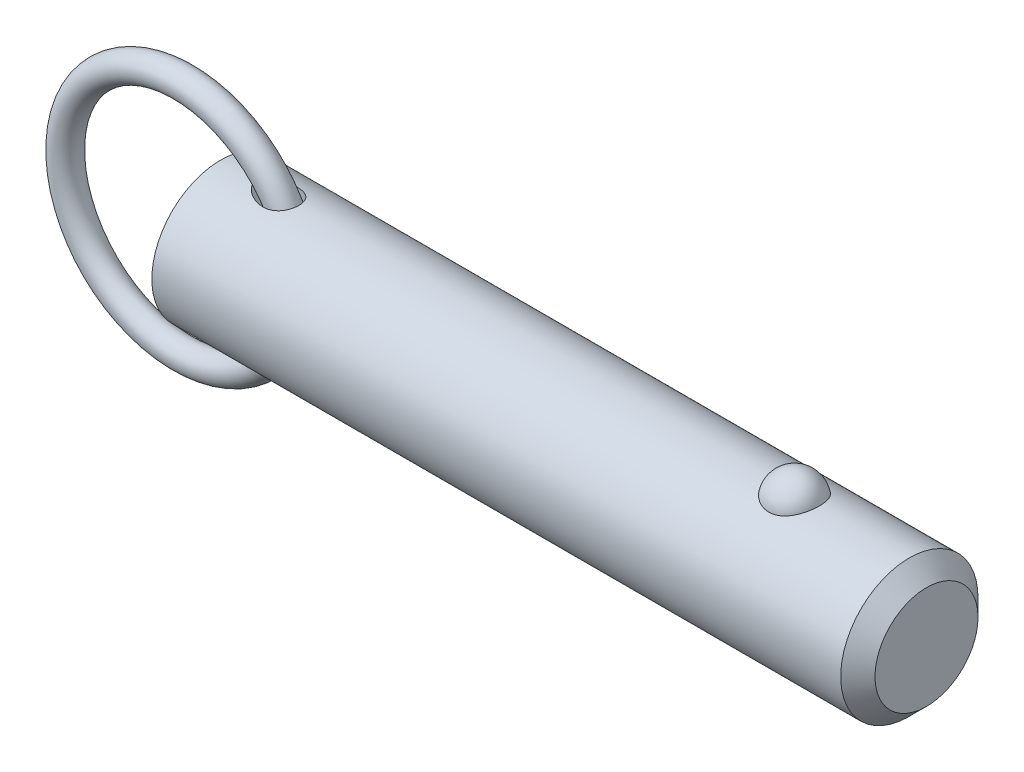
ISO-10303-21;
HEADER;
FILE_DESCRIPTION(('STEP AP214'),'2;1');
FILE_NAME('part.step','',(''),(''),'','','');
FILE_SCHEMA(('AUTOMOTIVE_DESIGN { 1 0 10303 214 1 1 1 1 }'));
ENDSEC;
DATA;
#1=APPLICATION_CONTEXT('core data for automotive mechanical design processes');
#2=APPLICATION_PROTOCOL_DEFINITION('international standard','automotive_design',2000,#1);
#3=PRODUCT_CONTEXT('',#1,'mechanical');
#4=PRODUCT('Part','Part','',(#3));
#5=PRODUCT_RELATED_PRODUCT_CATEGORY('part','',(#4));
#6=PRODUCT_DEFINITION_FORMATION('','',#4);
#7=PRODUCT_DEFINITION_CONTEXT('part definition',#1,'design');
#8=PRODUCT_DEFINITION('design','',#6,#7);
#9=PRODUCT_DEFINITION_SHAPE('','',#8);
#10=(LENGTH_UNIT() NAMED_UNIT(*) SI_UNIT(.MILLI.,.METRE.));
#11=(NAMED_UNIT(*) PLANE_ANGLE_UNIT() SI_UNIT($,.RADIAN.));
#12=(NAMED_UNIT(*) SI_UNIT($,.STERADIAN.) SOLID_ANGLE_UNIT());
#13=UNCERTAINTY_MEASURE_WITH_UNIT(LENGTH_MEASURE(1.E-05),#10,'distance_accuracy_value','');
#14=(GEOMETRIC_REPRESENTATION_CONTEXT(3) GLOBAL_UNCERTAINTY_ASSIGNED_CONTEXT((#13)) GLOBAL_UNIT_ASSIGNED_CONTEXT((#10,
#11,#12)) REPRESENTATION_CONTEXT('',''));
#15=CARTESIAN_POINT('',(0.,0.,0.));
#16=DIRECTION('',(0.,0.,1.));
#17=DIRECTION('',(1.,0.,0.));
#18=AXIS2_PLACEMENT_3D('',#15,#16,#17);
#19=CARTESIAN_POINT('',(-6.08699288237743,0.,0.));
#20=DIRECTION('',(0.,0.,1.));
#21=DIRECTION('',(1.,0.,0.));
#22=AXIS2_PLACEMENT_3D('',#19,#20,#21);
#23=TOROIDAL_SURFACE('',#22,19.05,2.223);
#24=CARTESIAN_POINT('',(15.1860071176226,0.,0.));
#25=VERTEX_POINT('',#24);
#26=VERTEX_LOOP('',#25);
#27=FACE_BOUND('',#26,.T.);
#28=ADVANCED_FACE('P0_F12',(#27),#23,.T.);
#29=CLOSED_SHELL('',(#28));
#30=MANIFOLD_SOLID_BREP('P0_B1',#29);
#31=CARTESIAN_POINT('',(0.,0.,0.));
#32=DIRECTION('',(1.,0.,0.));
#33=DIRECTION('',(0.,0.,-1.));
#34=AXIS2_PLACEMENT_3D('',#31,#32,#33);
#35=CYLINDRICAL_SURFACE('',#34,11.115);
#36=CARTESIAN_POINT('',(6.414051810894,11.0227946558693,-1.42871369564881));
#37=CARTESIAN_POINT('',(6.49338916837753,11.0115377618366,-1.5155664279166));
#38=CARTESIAN_POINT('',(6.57765461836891,10.9998263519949,-1.59789397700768));
#39=CARTESIAN_POINT('',(6.75386647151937,10.9760304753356,-1.75391400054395));
#40=CARTESIAN_POINT('',(6.84582247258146,10.9639455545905,-1.82759540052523));
#41=CARTESIAN_POINT('',(7.03627827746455,10.9397989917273,-1.96698954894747));
#42=CARTESIAN_POINT('',(7.13480838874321,10.9277377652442,-2.03266078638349));
#43=CARTESIAN_POINT('',(7.33681032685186,10.9041015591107,-2.1558582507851));
#44=CARTESIAN_POINT('',(7.44028007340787,10.8925263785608,-2.21338786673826));
#45=CARTESIAN_POINT('',(7.64386117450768,10.8710104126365,-2.31666528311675));
#46=CARTESIAN_POINT('',(7.74368989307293,10.8610119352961,-2.36295942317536));
#47=CARTESIAN_POINT('',(7.94637195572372,10.8420168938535,-2.44863486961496));
#48=CARTESIAN_POINT('',(8.04922612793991,10.8330206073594,-2.48801426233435));
#49=CARTESIAN_POINT('',(8.36115573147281,10.807980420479,-2.59542730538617));
#50=CARTESIAN_POINT('',(8.57411849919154,10.7938278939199,-2.65299817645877));
#51=CARTESIAN_POINT('',(9.00825016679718,10.7725818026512,-2.73800108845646));
#52=CARTESIAN_POINT('',(9.22947335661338,10.7655491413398,-2.76517330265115));
#53=CARTESIAN_POINT('',(9.67368141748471,10.7605872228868,-2.78445308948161));
#54=CARTESIAN_POINT('',(9.89666486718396,10.7626512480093,-2.77658653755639));
#55=CARTESIAN_POINT('',(10.2950172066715,10.7754452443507,-2.72644436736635));
#56=CARTESIAN_POINT('',(10.4712789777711,10.7844280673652,-2.69109376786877));
#57=CARTESIAN_POINT('',(10.7292776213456,10.8024982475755,-2.61722365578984));
#58=CARTESIAN_POINT('',(10.8142337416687,10.8092901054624,-2.58911576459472));
#59=CARTESIAN_POINT('',(10.9813218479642,10.8242580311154,-2.52581287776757));
#60=CARTESIAN_POINT('',(11.0634550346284,10.8324335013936,-2.49062094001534));
#61=CARTESIAN_POINT('',(11.2247418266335,10.8500287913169,-2.41281958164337));
#62=CARTESIAN_POINT('',(11.3038694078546,10.8594572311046,-2.37015806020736));
#63=CARTESIAN_POINT('',(11.4576781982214,10.8792243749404,-2.27770403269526));
#64=CARTESIAN_POINT('',(11.5323615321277,10.8895626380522,-2.22791497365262));
#65=CARTESIAN_POINT('',(11.6765388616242,10.9108113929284,-2.12140590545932));
#66=CARTESIAN_POINT('',(11.7460329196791,10.9217218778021,-2.064685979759));
#67=CARTESIAN_POINT('',(11.8790597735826,10.9437207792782,-1.94471764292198));
#68=CARTESIAN_POINT('',(11.9425932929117,10.9548091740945,-1.88147002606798));
#69=CARTESIAN_POINT('',(12.109388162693,10.9851999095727,-1.69784918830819));
#70=CARTESIAN_POINT('',(12.205655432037,11.0042655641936,-1.57093023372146));
#71=CARTESIAN_POINT('',(12.374151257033,11.0393391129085,-1.3017676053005));
#72=CARTESIAN_POINT('',(12.4463875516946,11.0553479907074,-1.15952888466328));
#73=CARTESIAN_POINT('',(12.5615818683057,11.0816338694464,-0.871972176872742));
#74=CARTESIAN_POINT('',(12.6058896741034,11.0921698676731,-0.72721773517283));
#75=CARTESIAN_POINT('',(12.6699315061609,11.1075802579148,-0.432089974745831));
#76=CARTESIAN_POINT('',(12.6896681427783,11.1124552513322,-0.281717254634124));
#77=CARTESIAN_POINT('',(12.704022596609,11.1159901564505,0.0188164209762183));
#78=CARTESIAN_POINT('',(12.6988836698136,11.1147102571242,0.16896512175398));
#79=CARTESIAN_POINT('',(12.6641681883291,11.1062126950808,0.466238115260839));
#80=CARTESIAN_POINT('',(12.6345920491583,11.0989951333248,0.613362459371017));
#81=CARTESIAN_POINT('',(12.5517453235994,11.0794095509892,0.900330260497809));
#82=CARTESIAN_POINT('',(12.4984878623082,11.0670443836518,1.04017770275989));
#83=CARTESIAN_POINT('',(12.3696588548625,11.0385082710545,1.308745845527));
#84=CARTESIAN_POINT('',(12.2940887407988,11.0223375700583,1.43746725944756));
#85=CARTESIAN_POINT('',(12.122380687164,10.987872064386,1.68079704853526));
#86=CARTESIAN_POINT('',(12.0261637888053,10.969569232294,1.79534850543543));
#87=CARTESIAN_POINT('',(11.8161707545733,10.932836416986,2.00695695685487));
#88=CARTESIAN_POINT('',(11.7023941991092,10.9144064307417,2.10401353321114));
#89=CARTESIAN_POINT('',(11.4575656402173,10.8788057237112,2.28105326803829));
#90=CARTESIAN_POINT('',(11.3261451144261,10.8616794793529,2.36053412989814));
#91=CARTESIAN_POINT('',(11.0523589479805,10.8308019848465,2.49839044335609));
#92=CARTESIAN_POINT('',(10.9099908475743,10.8170514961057,2.55676113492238));
#93=CARTESIAN_POINT('',(10.6060622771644,10.7929728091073,2.65666105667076));
#94=CARTESIAN_POINT('',(10.4438877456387,10.7830209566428,2.69640163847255));
#95=CARTESIAN_POINT('',(10.1154037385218,10.7687230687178,2.75293129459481));
#96=CARTESIAN_POINT('',(9.94909141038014,10.7643810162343,2.76970406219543));
#97=CARTESIAN_POINT('',(9.54387061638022,10.7604809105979,2.7848723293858));
#98=CARTESIAN_POINT('',(9.30446860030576,10.7637793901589,2.7722775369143));
#99=CARTESIAN_POINT('',(8.94961255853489,10.7757341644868,2.72524141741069));
#100=CARTESIAN_POINT('',(8.83186896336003,10.7808994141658,2.70482239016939));
#101=CARTESIAN_POINT('',(8.59835142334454,10.7932548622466,2.6550999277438));
#102=CARTESIAN_POINT('',(8.48257728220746,10.8004448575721,2.62579738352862));
#103=CARTESIAN_POINT('',(8.25208469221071,10.8166382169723,2.55827624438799));
#104=CARTESIAN_POINT('',(8.13740214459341,10.8256649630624,2.51994155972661));
#105=CARTESIAN_POINT('',(7.91132058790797,10.8451170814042,2.43486475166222));
#106=CARTESIAN_POINT('',(7.79992154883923,10.8555424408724,2.38812270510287));
#107=CARTESIAN_POINT('',(7.58115677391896,10.8774251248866,2.28638483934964));
#108=CARTESIAN_POINT('',(7.47378802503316,10.8888816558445,2.23139534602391));
#109=CARTESIAN_POINT('',(7.26385624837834,10.9124540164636,2.1131026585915));
#110=CARTESIAN_POINT('',(7.16129168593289,10.9245696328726,2.04980214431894));
#111=CARTESIAN_POINT('',(6.91882218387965,10.9543689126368,1.88540538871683));
#112=CARTESIAN_POINT('',(6.78193778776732,10.9721958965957,1.77979827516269));
#113=CARTESIAN_POINT('',(6.52472441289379,11.0070222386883,1.54989693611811));
#114=CARTESIAN_POINT('',(6.40436902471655,11.0240228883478,1.42563320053));
#115=CARTESIAN_POINT('',(6.21838804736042,11.0509658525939,1.19529359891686));
#116=CARTESIAN_POINT('',(6.14691885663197,11.0615430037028,1.09404520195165));
#117=CARTESIAN_POINT('',(6.02043496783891,11.0805004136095,0.881508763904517));
#118=CARTESIAN_POINT('',(5.96539400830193,11.0888841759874,0.770237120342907));
#119=CARTESIAN_POINT('',(5.88475453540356,11.1012553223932,0.560577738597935));
#120=CARTESIAN_POINT('',(5.85559643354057,11.1057686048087,0.463603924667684));
#121=CARTESIAN_POINT('',(5.81381299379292,11.1122523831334,0.266083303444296));
#122=CARTESIAN_POINT('',(5.80117118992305,11.1142254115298,0.165540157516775));
#123=CARTESIAN_POINT('',(5.79363815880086,11.1153999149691,-0.0364747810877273));
#124=CARTESIAN_POINT('',(5.79878799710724,11.1145949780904,-0.137948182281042));
#125=CARTESIAN_POINT('',(5.82639592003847,11.1102987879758,-0.338493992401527));
#126=CARTESIAN_POINT('',(5.84887234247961,11.1068046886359,-0.437563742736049));
#127=CARTESIAN_POINT('',(5.91510741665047,11.0965857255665,-0.649968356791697));
#128=CARTESIAN_POINT('',(5.96220905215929,11.0893566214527,-0.762222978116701));
#129=CARTESIAN_POINT('',(6.0737844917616,11.072471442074,-0.977396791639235));
#130=CARTESIAN_POINT('',(6.13826787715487,11.0628140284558,-1.08031079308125));
#131=CARTESIAN_POINT('',(6.24101077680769,11.0477136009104,-1.2219580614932));
#132=CARTESIAN_POINT('',(6.27403486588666,11.042895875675,-1.26469183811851));
#133=CARTESIAN_POINT('',(6.34238022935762,11.0330152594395,-1.34817011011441));
#134=CARTESIAN_POINT('',(6.37769867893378,11.0279526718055,-1.38891694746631));
#135=CARTESIAN_POINT('',(6.414051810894,11.0227946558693,-1.42871369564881));
#136=B_SPLINE_CURVE_WITH_KNOTS('',3,(#36,#37,#38,#39,#40,#41,#42,#43,#44,#45,#46,#47,#48,#49,
#50,#51,#52,#53,#54,#55,#56,#57,#58,#59,#60,#61,#62,#63,#64,#65,#66,#67,#68,#69,#70,#71,#72,#73,
#74,#75,#76,#77,#78,#79,#80,#81,#82,#83,#84,#85,#86,#87,#88,#89,#90,#91,#92,#93,#94,#95,#96,#97,
#98,#99,#100,#101,#102,#103,#104,#105,#106,#107,#108,#109,#110,#111,#112,#113,#114,#115,#116,
#117,#118,#119,#120,#121,#122,#123,#124,#125,#126,#127,#128,#129,#130,#131,#132,#133,#134,#135),
.UNSPECIFIED.,.T.,.F.,(4,2,2,2,2,2,2,2,2,2,2,2,2,2,2,2,2,2,2,2,2,2,2,2,2,2,2,2,2,2,2,2,2,2,2,2,
2,2,2,2,2,2,2,2,2,2,2,2,2,4),(0.,0.354433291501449,0.709315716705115,1.0659654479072,
1.42246628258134,1.75367157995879,2.08496839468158,2.74582009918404,3.41227815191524,
4.07824412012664,4.61583787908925,4.88478112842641,5.15360853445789,5.42439170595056,
5.6950443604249,5.96569375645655,6.23631025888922,6.7149072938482,7.1933500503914,
7.6464143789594,8.09943057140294,8.54802575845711,8.99661331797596,9.44495256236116,
9.89326303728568,10.3433195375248,10.7933867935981,11.2550086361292,11.7167345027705,
12.2165866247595,12.7167934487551,13.4318876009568,13.7904664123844,14.1490092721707,
14.5124394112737,14.8758662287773,15.239015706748,15.6020483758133,16.1219860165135,
16.6410830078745,17.0130520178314,17.3844231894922,17.6872330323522,17.9897407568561,
18.2929471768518,18.5964749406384,18.9603532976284,19.3244326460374,19.4870338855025,
19.649438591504),.UNSPECIFIED.);
#137=CARTESIAN_POINT('',(6.414051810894,11.0227946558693,-1.42871369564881));
#138=VERTEX_POINT('',#137);
#139=EDGE_CURVE('P1_E40',#138,#138,#136,.T.);
#140=ORIENTED_EDGE('',*,*,#139,.T.);
#141=EDGE_LOOP('',(#140));
#142=FACE_BOUND('',#141,.T.);
#143=CARTESIAN_POINT('',(111.52125,0.,0.));
#144=DIRECTION('',(1.,0.,0.));
#145=DIRECTION('',(0.,0.,-1.));
#146=AXIS2_PLACEMENT_3D('',#143,#144,#145);
#147=CIRCLE('',#146,11.115);
#148=CARTESIAN_POINT('',(111.52125,0.,-11.115));
#149=VERTEX_POINT('',#148);
#150=EDGE_CURVE('P1_E25',#149,#149,#147,.T.);
#151=ORIENTED_EDGE('',*,*,#150,.F.);
#152=EDGE_LOOP('',(#151));
#153=FACE_BOUND('',#152,.T.);
#154=CARTESIAN_POINT('',(0.,0.,0.));
#155=DIRECTION('',(1.,0.,0.));
#156=DIRECTION('',(0.,0.,-1.));
#157=AXIS2_PLACEMENT_3D('',#154,#155,#156);
#158=CIRCLE('',#157,11.115);
#159=CARTESIAN_POINT('',(0.,0.,-11.115));
#160=VERTEX_POINT('',#159);
#161=EDGE_CURVE('P1_E9',#160,#160,#158,.T.);
#162=ORIENTED_EDGE('',*,*,#161,.T.);
#163=EDGE_LOOP('',(#162));
#164=FACE_BOUND('',#163,.T.);
#165=CARTESIAN_POINT('',(92.9310680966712,10.3028087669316,4.17077409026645));
#166=CARTESIAN_POINT('',(92.7147756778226,10.3028003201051,4.17078240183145));
#167=CARTESIAN_POINT('',(92.4985488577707,10.3098895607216,4.15340593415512));
#168=CARTESIAN_POINT('',(92.0725408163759,10.3373834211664,4.08449540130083));
#169=CARTESIAN_POINT('',(91.8627577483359,10.3577841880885,4.0329712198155));
#170=CARTESIAN_POINT('',(91.4557825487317,10.4095237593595,3.89746513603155));
#171=CARTESIAN_POINT('',(91.2585726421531,10.4408466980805,3.81353029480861));
#172=CARTESIAN_POINT('',(90.8813382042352,10.5110236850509,3.61560339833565));
#173=CARTESIAN_POINT('',(90.7013171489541,10.5498792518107,3.50160528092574));
#174=CARTESIAN_POINT('',(90.3576842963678,10.6322884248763,3.24292464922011));
#175=CARTESIAN_POINT('',(90.1946861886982,10.6759443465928,3.09746040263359));
#176=CARTESIAN_POINT('',(89.8945911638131,10.7625291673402,2.78171925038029));
#177=CARTESIAN_POINT('',(89.7574990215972,10.8054579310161,2.61143778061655));
#178=CARTESIAN_POINT('',(89.5064084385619,10.8881935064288,2.24226695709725));
#179=CARTESIAN_POINT('',(89.3937105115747,10.9277761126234,2.04244123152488));
#180=CARTESIAN_POINT('',(89.2017771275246,10.997484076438,1.62578254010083));
#181=CARTESIAN_POINT('',(89.1225446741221,11.0276085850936,1.40894804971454));
#182=CARTESIAN_POINT('',(88.9983034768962,11.0756732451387,0.961250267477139));
#183=CARTESIAN_POINT('',(88.953760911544,11.0934470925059,0.730239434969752));
#184=CARTESIAN_POINT('',(88.9015695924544,11.1143331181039,0.263439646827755));
#185=CARTESIAN_POINT('',(88.8939200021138,11.1174456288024,0.0276507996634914));
#186=CARTESIAN_POINT('',(88.9156105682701,11.1087161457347,-0.440729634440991));
#187=CARTESIAN_POINT('',(88.9447624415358,11.0969502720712,-0.673331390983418));
#188=CARTESIAN_POINT('',(89.0391432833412,11.0597872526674,-1.12996621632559));
#189=CARTESIAN_POINT('',(89.1043729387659,11.0343898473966,-1.35399912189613));
#190=CARTESIAN_POINT('',(89.2696984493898,10.972515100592,-1.78750286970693));
#191=CARTESIAN_POINT('',(89.3698386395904,10.9360236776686,-1.99695478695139));
#192=CARTESIAN_POINT('',(89.6029408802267,10.8557595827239,-2.3952066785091));
#193=CARTESIAN_POINT('',(89.735905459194,10.8119863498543,-2.58400506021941));
#194=CARTESIAN_POINT('',(90.0324076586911,10.7216733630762,-2.93635726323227));
#195=CARTESIAN_POINT('',(90.1960565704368,10.675123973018,-3.09981510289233));
#196=CARTESIAN_POINT('',(90.5498601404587,10.5846571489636,-3.39592247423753));
#197=CARTESIAN_POINT('',(90.7400123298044,10.5407394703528,-3.52857487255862));
#198=CARTESIAN_POINT('',(91.1375014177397,10.4616690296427,-3.75646057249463));
#199=CARTESIAN_POINT('',(91.3443670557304,10.4263443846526,-3.8524543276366));
#200=CARTESIAN_POINT('',(91.7729541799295,10.3675574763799,-4.00798747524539));
#201=CARTESIAN_POINT('',(91.994670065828,10.344090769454,-4.0675405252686));
#202=CARTESIAN_POINT('',(92.4346695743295,10.3128282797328,-4.14614314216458));
#203=CARTESIAN_POINT('',(92.6525654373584,10.3043040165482,-4.1670783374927));
#204=CARTESIAN_POINT('',(93.08894951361,10.3016771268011,-4.17357158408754));
#205=CARTESIAN_POINT('',(93.3074376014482,10.3075716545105,-4.15913661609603));
#206=CARTESIAN_POINT('',(93.7317442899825,10.3326686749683,-4.09636961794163));
#207=CARTESIAN_POINT('',(93.9377458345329,10.3514555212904,-4.0490957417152));
#208=CARTESIAN_POINT('',(94.3385764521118,10.399818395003,-3.92320197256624));
#209=CARTESIAN_POINT('',(94.5334046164,10.4293952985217,-3.84457953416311));
#210=CARTESIAN_POINT('',(94.9111917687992,10.4969600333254,-3.65612410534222));
#211=CARTESIAN_POINT('',(95.0937974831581,10.5351178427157,-3.54564545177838));
#212=CARTESIAN_POINT('',(95.4382040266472,10.6154999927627,-3.29718036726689));
#213=CARTESIAN_POINT('',(95.6000000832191,10.657725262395,-3.15918764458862));
#214=CARTESIAN_POINT('',(95.9069596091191,10.744212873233,-2.85163580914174));
#215=CARTESIAN_POINT('',(96.0508919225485,10.7884718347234,-2.68084605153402));
#216=CARTESIAN_POINT('',(96.3092371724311,10.872374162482,-2.3172186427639));
#217=CARTESIAN_POINT('',(96.4236448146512,10.9120167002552,-2.12437704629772));
#218=CARTESIAN_POINT('',(96.6238739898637,10.9838919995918,-1.71516999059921));
#219=CARTESIAN_POINT('',(96.7086617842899,11.0158465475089,-1.498248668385));
#220=CARTESIAN_POINT('',(96.8426838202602,11.0673523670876,-1.05228572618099));
#221=CARTESIAN_POINT('',(96.8919174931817,11.086903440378,-0.823243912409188));
#222=CARTESIAN_POINT('',(96.9538915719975,11.1116323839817,-0.359087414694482));
#223=CARTESIAN_POINT('',(96.9665662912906,11.1167843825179,-0.123962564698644));
#224=CARTESIAN_POINT('',(96.954973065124,11.1121144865,0.345220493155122));
#225=CARTESIAN_POINT('',(96.9307056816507,11.1022928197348,0.579278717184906));
#226=CARTESIAN_POINT('',(96.8459073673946,11.0687504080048,1.03866534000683));
#227=CARTESIAN_POINT('',(96.785529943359,11.0450885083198,1.26402641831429));
#228=CARTESIAN_POINT('',(96.6298532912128,10.9863185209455,1.70076772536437));
#229=CARTESIAN_POINT('',(96.534551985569,10.9512097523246,1.91214712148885));
#230=CARTESIAN_POINT('',(96.3103974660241,10.8729733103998,2.31608359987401));
#231=CARTESIAN_POINT('',(96.1813806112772,10.8298068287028,2.50854240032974));
#232=CARTESIAN_POINT('',(95.8927327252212,10.7401896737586,2.86808766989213));
#233=CARTESIAN_POINT('',(95.7331022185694,10.6937390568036,3.03517457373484));
#234=CARTESIAN_POINT('',(95.3875341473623,10.6029321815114,3.33857581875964));
#235=CARTESIAN_POINT('',(95.2017089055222,10.5585680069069,3.47501541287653));
#236=CARTESIAN_POINT('',(94.8078750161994,10.4769321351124,3.71390897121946));
#237=CARTESIAN_POINT('',(94.5998635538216,10.439661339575,3.81635861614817));
#238=CARTESIAN_POINT('',(94.1540666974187,10.3749407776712,3.98910631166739));
#239=CARTESIAN_POINT('',(93.9152342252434,10.3482457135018,4.05700929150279));
#240=CARTESIAN_POINT('',(93.4279254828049,10.312188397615,4.14782844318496));
#241=CARTESIAN_POINT('',(93.1794535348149,10.3028184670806,4.17076454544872));
#242=CARTESIAN_POINT('',(92.9310680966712,10.3028087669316,4.17077409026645));
#243=B_SPLINE_CURVE_WITH_KNOTS('',3,(#165,#166,#167,#168,#169,#170,#171,#172,#173,#174,#175,
#176,#177,#178,#179,#180,#181,#182,#183,#184,#185,#186,#187,#188,#189,#190,#191,#192,#193,#194,
#195,#196,#197,#198,#199,#200,#201,#202,#203,#204,#205,#206,#207,#208,#209,#210,#211,#212,#213,
#214,#215,#216,#217,#218,#219,#220,#221,#222,#223,#224,#225,#226,#227,#228,#229,#230,#231,#232,
#233,#234,#235,#236,#237,#238,#239,#240,#241,#242),.UNSPECIFIED.,.T.,.F.,(4,2,2,2,2,2,2,2,2,2,2,
2,2,2,2,2,2,2,2,2,2,2,2,2,2,2,2,2,2,2,2,2,2,2,2,2,2,2,4),(0.,0.647966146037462,1.29574482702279,
1.94258643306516,2.58955857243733,3.25496465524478,3.92049326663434,4.61566368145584,
5.31089647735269,6.01531821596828,6.71972398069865,7.42054043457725,8.12137023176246,
8.82309331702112,9.52487047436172,10.2292439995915,10.9335519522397,11.6223330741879,
12.3108558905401,12.9647664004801,13.6185478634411,14.2521847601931,14.8858731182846,
15.5334360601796,16.1811472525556,16.8611459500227,17.5412664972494,18.2431855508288,
18.9451158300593,19.6483065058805,20.3514864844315,21.0516982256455,21.7519516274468,
22.4556690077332,23.1593743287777,23.8601491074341,24.5610129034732,25.3054529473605,
26.049562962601),.UNSPECIFIED.);
#244=CARTESIAN_POINT('',(92.9310680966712,10.3028087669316,4.17077409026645));
#245=VERTEX_POINT('',#244);
#246=EDGE_CURVE('P1_E34',#245,#245,#243,.T.);
#247=ORIENTED_EDGE('',*,*,#246,.T.);
#248=EDGE_LOOP('',(#247));
#249=FACE_BOUND('',#248,.T.);
#250=CARTESIAN_POINT('',(6.414051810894,-11.0227946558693,-1.42871369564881));
#251=CARTESIAN_POINT('',(6.3312406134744,-11.0345445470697,-1.33806125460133));
#252=CARTESIAN_POINT('',(6.25372866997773,-11.0458090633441,-1.24240732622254));
#253=CARTESIAN_POINT('',(6.11277905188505,-11.0666115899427,-1.04095704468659));
#254=CARTESIAN_POINT('',(6.04933920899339,-11.0761498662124,-0.935162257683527));
#255=CARTESIAN_POINT('',(5.94029181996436,-11.0927063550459,-0.712476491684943));
#256=CARTESIAN_POINT('',(5.89492964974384,-11.0996897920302,-0.595457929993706));
#257=CARTESIAN_POINT('',(5.8449816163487,-11.1074141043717,-0.414997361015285));
#258=CARTESIAN_POINT('',(5.83135004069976,-11.1095300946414,-0.354047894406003));
#259=CARTESIAN_POINT('',(5.81051649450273,-11.1127688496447,-0.23104152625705));
#260=CARTESIAN_POINT('',(5.80331311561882,-11.1138918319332,-0.168984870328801));
#261=CARTESIAN_POINT('',(5.7929652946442,-11.1155042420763,-0.000484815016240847));
#262=CARTESIAN_POINT('',(5.79625267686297,-11.1149904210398,0.106437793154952));
#263=CARTESIAN_POINT('',(5.82213676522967,-11.1109609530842,0.317809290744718));
#264=CARTESIAN_POINT('',(5.84474662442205,-11.1074432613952,0.422256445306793));
#265=CARTESIAN_POINT('',(5.91113114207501,-11.097197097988,0.639361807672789));
#266=CARTESIAN_POINT('',(5.95733120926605,-11.090102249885,0.751250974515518));
#267=CARTESIAN_POINT('',(6.06709542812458,-11.0734770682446,0.965912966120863));
#268=CARTESIAN_POINT('',(6.13068735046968,-11.06394284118,1.06867085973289));
#269=CARTESIAN_POINT('',(6.30294237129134,-11.0385920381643,1.30890635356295));
#270=CARTESIAN_POINT('',(6.41896200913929,-11.0218881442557,1.44097376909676));
#271=CARTESIAN_POINT('',(6.66989654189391,-10.9871512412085,1.68553954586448));
#272=CARTESIAN_POINT('',(6.80485520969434,-10.9691152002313,1.79799117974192));
#273=CARTESIAN_POINT('',(7.04881236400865,-10.9382283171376,1.97587596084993));
#274=CARTESIAN_POINT('',(7.15465712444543,-10.9253240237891,2.04570822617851));
#275=CARTESIAN_POINT('',(7.37202504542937,-10.9000987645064,2.17611840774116));
#276=CARTESIAN_POINT('',(7.48355057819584,-10.8877780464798,2.23669241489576));
#277=CARTESIAN_POINT('',(7.71132418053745,-10.8641580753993,2.34873831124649));
#278=CARTESIAN_POINT('',(7.82757727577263,-10.8528599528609,2.40020018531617));
#279=CARTESIAN_POINT('',(8.06386825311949,-10.8317234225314,2.49385169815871));
#280=CARTESIAN_POINT('',(8.18390558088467,-10.8218848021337,2.53604268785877));
#281=CARTESIAN_POINT('',(8.42918336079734,-10.8039208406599,2.61152283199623));
#282=CARTESIAN_POINT('',(8.55447802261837,-10.7958283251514,2.64464414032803));
#283=CARTESIAN_POINT('',(8.8075212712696,-10.781995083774,2.70048793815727));
#284=CARTESIAN_POINT('',(8.93527019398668,-10.7762546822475,2.72320899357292));
#285=CARTESIAN_POINT('',(9.19210176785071,-10.7675291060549,2.75750994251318));
#286=CARTESIAN_POINT('',(9.32118105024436,-10.7645381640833,2.76911315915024));
#287=CARTESIAN_POINT('',(9.57984338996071,-10.761622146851,2.78042035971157));
#288=CARTESIAN_POINT('',(9.70942621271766,-10.7616957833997,2.78012934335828));
#289=CARTESIAN_POINT('',(10.0243125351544,-10.7659059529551,2.76381534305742));
#290=CARTESIAN_POINT('',(10.209307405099,-10.7717977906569,2.74099674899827));
#291=CARTESIAN_POINT('',(10.5731188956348,-10.7905408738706,2.66626238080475));
#292=CARTESIAN_POINT('',(10.7519389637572,-10.8033881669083,2.61436313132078));
#293=CARTESIAN_POINT('',(11.0114289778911,-10.8271584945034,2.51336808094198));
#294=CARTESIAN_POINT('',(11.096831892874,-10.835881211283,2.47562331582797));
#295=CARTESIAN_POINT('',(11.2636000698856,-10.8545688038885,2.39236170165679));
#296=CARTESIAN_POINT('',(11.3449673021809,-10.8645330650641,2.3468486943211));
#297=CARTESIAN_POINT('',(11.5027832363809,-10.8853818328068,2.24815967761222));
#298=CARTESIAN_POINT('',(11.5792327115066,-10.8962661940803,2.19498487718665));
#299=CARTESIAN_POINT('',(11.7263315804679,-10.9185541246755,2.08128855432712));
#300=CARTESIAN_POINT('',(11.7969818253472,-10.9299576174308,2.02076811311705));
#301=CARTESIAN_POINT('',(11.9817953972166,-10.9613645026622,1.84513663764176));
#302=CARTESIAN_POINT('',(12.0893012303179,-10.9814643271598,1.72286660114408));
#303=CARTESIAN_POINT('',(12.2803576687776,-11.0193991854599,1.46066991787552));
#304=CARTESIAN_POINT('',(12.3639173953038,-11.0372350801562,1.3207500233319));
#305=CARTESIAN_POINT('',(12.4996220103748,-11.0672969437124,1.03778067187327));
#306=CARTESIAN_POINT('',(12.5535315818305,-11.0798242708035,0.895607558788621));
#307=CARTESIAN_POINT('',(12.636874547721,-11.0995427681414,0.603918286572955));
#308=CARTESIAN_POINT('',(12.6663115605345,-11.1067347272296,0.454403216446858));
#309=CARTESIAN_POINT('',(12.6997387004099,-11.1149224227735,0.154577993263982));
#310=CARTESIAN_POINT('',(12.7040886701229,-11.1160057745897,0.00431019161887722));
#311=CARTESIAN_POINT('',(12.6882048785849,-11.1120956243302,-0.29484108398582));
#312=CARTESIAN_POINT('',(12.6679715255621,-11.1071022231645,-0.443724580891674));
#313=CARTESIAN_POINT('',(12.6034470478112,-11.0915888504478,-0.735688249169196));
#314=CARTESIAN_POINT('',(12.5591858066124,-11.0810757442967,-0.878775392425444));
#315=CARTESIAN_POINT('',(12.4477416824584,-11.0556687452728,-1.15529525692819));
#316=CARTESIAN_POINT('',(12.3805601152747,-11.0407751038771,-1.2887285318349));
#317=CARTESIAN_POINT('',(12.2248919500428,-11.0081839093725,-1.54257976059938));
#318=CARTESIAN_POINT('',(12.1363549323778,-10.9904797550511,-1.66296592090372));
#319=CARTESIAN_POINT('',(11.9406137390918,-10.9541951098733,-1.88726577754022));
#320=CARTESIAN_POINT('',(11.833409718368,-10.9356146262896,-1.99117961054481));
#321=CARTESIAN_POINT('',(11.601318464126,-10.8991360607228,-2.18213646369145));
#322=CARTESIAN_POINT('',(11.4761325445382,-10.8812577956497,-2.26881927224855));
#323=CARTESIAN_POINT('',(11.2134852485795,-10.8482871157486,-2.42157282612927));
#324=CARTESIAN_POINT('',(11.0760218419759,-10.8331951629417,-2.48764015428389));
#325=CARTESIAN_POINT('',(10.7828968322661,-10.8061050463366,-2.60290068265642));
#326=CARTESIAN_POINT('',(10.6266338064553,-10.7943907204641,-2.65062248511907));
#327=CARTESIAN_POINT('',(10.3086617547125,-10.7762429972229,-2.72345054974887));
#328=CARTESIAN_POINT('',(10.146948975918,-10.7698133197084,-2.74854088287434));
#329=CARTESIAN_POINT('',(9.75541304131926,-10.7608036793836,-2.78368719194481));
#330=CARTESIAN_POINT('',(9.52459435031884,-10.7608467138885,-2.78350276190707));
#331=CARTESIAN_POINT('',(9.06604960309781,-10.7702674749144,-2.74677945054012));
#332=CARTESIAN_POINT('',(8.83832966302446,-10.7796615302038,-2.71017697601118));
#333=CARTESIAN_POINT('',(8.38783466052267,-10.8058248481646,-2.60392490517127));
#334=CARTESIAN_POINT('',(8.1651710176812,-10.8226939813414,-2.53382676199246));
#335=CARTESIAN_POINT('',(7.84087311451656,-10.8516548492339,-2.40555545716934));
#336=CARTESIAN_POINT('',(7.73435551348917,-10.8619221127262,-2.35892455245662));
#337=CARTESIAN_POINT('',(7.52510420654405,-10.883357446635,-2.25797017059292));
#338=CARTESIAN_POINT('',(7.4223698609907,-10.8945253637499,-2.20364800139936));
#339=CARTESIAN_POINT('',(7.23808758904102,-10.915528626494,-2.09688018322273));
#340=CARTESIAN_POINT('',(7.15584631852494,-10.9252787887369,-2.0456107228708));
#341=CARTESIAN_POINT('',(6.99510576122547,-10.944960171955,-1.93754729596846));
#342=CARTESIAN_POINT('',(6.91660574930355,-10.9548913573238,-1.88075440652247));
#343=CARTESIAN_POINT('',(6.76418133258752,-10.974690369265,-1.76154504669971));
#344=CARTESIAN_POINT('',(6.69024940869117,-10.9845582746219,-1.6991382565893));
#345=CARTESIAN_POINT('',(6.54780119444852,-11.0039826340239,-1.56842485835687));
#346=CARTESIAN_POINT('',(6.47928247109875,-11.0135392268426,-1.50012092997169));
#347=CARTESIAN_POINT('',(6.414051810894,-11.0227946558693,-1.42871369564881));
#348=B_SPLINE_CURVE_WITH_KNOTS('',3,(#250,#251,#252,#253,#254,#255,#256,#257,#258,#259,#260,
#261,#262,#263,#264,#265,#266,#267,#268,#269,#270,#271,#272,#273,#274,#275,#276,#277,#278,#279,
#280,#281,#282,#283,#284,#285,#286,#287,#288,#289,#290,#291,#292,#293,#294,#295,#296,#297,#298,
#299,#300,#301,#302,#303,#304,#305,#306,#307,#308,#309,#310,#311,#312,#313,#314,#315,#316,#317,
#318,#319,#320,#321,#322,#323,#324,#325,#326,#327,#328,#329,#330,#331,#332,#333,#334,#335,#336,
#337,#338,#339,#340,#341,#342,#343,#344,#345,#346,#347),.UNSPECIFIED.,.T.,.F.,(4,2,2,2,2,2,2,2,
2,2,2,2,2,2,2,2,2,2,2,2,2,2,2,2,2,2,2,2,2,2,2,2,2,2,2,2,2,2,2,2,2,2,2,2,2,2,2,2,4),(0.,
0.369835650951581,0.739614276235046,1.1142538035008,1.30141910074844,1.48854338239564,
1.8074587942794,2.12659146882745,2.4883888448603,2.85076733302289,3.3776216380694,
3.90571433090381,4.287639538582,4.66972556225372,5.05222896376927,5.43467659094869,
5.82378546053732,6.21294796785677,6.60129228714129,6.9894733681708,7.54669558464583,
8.10360148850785,8.38458539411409,8.66543074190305,8.94623182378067,9.22699162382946,
9.7162888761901,10.2053995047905,10.6608871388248,11.1163074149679,11.5651786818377,
12.0140424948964,12.4623493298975,12.9106304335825,13.3599804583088,13.8093267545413,
14.2672570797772,14.7252632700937,15.214740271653,15.7045615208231,16.3932594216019,
17.083162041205,17.7825738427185,18.1325177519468,18.4824022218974,18.7744056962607,
19.0663523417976,19.3578048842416,19.6491256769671),.UNSPECIFIED.);
#349=CARTESIAN_POINT('',(6.414051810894,-11.0227946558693,-1.42871369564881));
#350=VERTEX_POINT('',#349);
#351=EDGE_CURVE('P1_E17',#350,#350,#348,.T.);
#352=ORIENTED_EDGE('',*,*,#351,.T.);
#353=EDGE_LOOP('',(#352));
#354=FACE_BOUND('',#353,.T.);
#355=ADVANCED_FACE('P1_F13',(#142,#153,#164,#249,#354),#35,.T.);
#356=CARTESIAN_POINT('',(0.,0.,0.));
#357=DIRECTION('',(-1.,0.,0.));
#358=DIRECTION('',(0.,0.,1.));
#359=AXIS2_PLACEMENT_3D('',#356,#357,#358);
#360=PLANE('',#359);
#361=ORIENTED_EDGE('',*,*,#161,.F.);
#362=EDGE_LOOP('',(#361));
#363=FACE_BOUND('',#362,.T.);
#364=ADVANCED_FACE('P1_F15',(#363),#360,.T.);
#365=CARTESIAN_POINT('',(114.3,0.,0.));
#366=DIRECTION('',(-1.,0.,0.));
#367=DIRECTION('',(0.,0.,1.));
#368=AXIS2_PLACEMENT_3D('',#365,#366,#367);
#369=CONICAL_SURFACE('',#368,8.33625000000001,0.785398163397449);
#370=ORIENTED_EDGE('',*,*,#150,.T.);
#371=EDGE_LOOP('',(#370));
#372=FACE_BOUND('',#371,.T.);
#373=CARTESIAN_POINT('',(114.3,0.,0.));
#374=DIRECTION('',(1.,0.,0.));
#375=DIRECTION('',(0.,0.,-1.));
#376=AXIS2_PLACEMENT_3D('',#373,#374,#375);
#377=CIRCLE('',#376,8.33625000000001);
#378=CARTESIAN_POINT('',(114.3,0.,-8.33625000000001));
#379=VERTEX_POINT('',#378);
#380=EDGE_CURVE('P1_E30',#379,#379,#377,.T.);
#381=ORIENTED_EDGE('',*,*,#380,.F.);
#382=EDGE_LOOP('',(#381));
#383=FACE_BOUND('',#382,.T.);
#384=ADVANCED_FACE('P1_F55',(#372,#383),#369,.T.);
#385=CARTESIAN_POINT('',(114.3,8.33625000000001,0.));
#386=DIRECTION('',(1.,0.,0.));
#387=DIRECTION('',(0.,0.,-1.));
#388=AXIS2_PLACEMENT_3D('',#385,#386,#387);
#389=PLANE('',#388);
#390=ORIENTED_EDGE('',*,*,#380,.T.);
#391=EDGE_LOOP('',(#390));
#392=FACE_BOUND('',#391,.T.);
#393=ADVANCED_FACE('P1_F51',(#392),#389,.T.);
#394=CARTESIAN_POINT('',(92.9310680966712,10.0035,0.));
#395=DIRECTION('',(-1.,0.,0.));
#396=DIRECTION('',(0.,1.,0.));
#397=AXIS2_PLACEMENT_3D('',#394,#395,#396);
#398=SPHERICAL_SURFACE('',#397,4.18150000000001);
#399=ORIENTED_EDGE('',*,*,#246,.F.);
#400=EDGE_LOOP('',(#399));
#401=FACE_BOUND('',#400,.T.);
#402=ADVANCED_FACE('P1_F46',(#401),#398,.T.);
#403=CARTESIAN_POINT('',(-6.08699288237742,0.,0.));
#404=DIRECTION('',(0.,0.,1.));
#405=DIRECTION('',(1.,0.,0.));
#406=AXIS2_PLACEMENT_3D('',#403,#404,#405);
#407=TOROIDAL_SURFACE('',#406,19.05,2.77875);
#408=ORIENTED_EDGE('',*,*,#351,.F.);
#409=EDGE_LOOP('',(#408));
#410=FACE_BOUND('',#409,.T.);
#411=ORIENTED_EDGE('',*,*,#139,.F.);
#412=EDGE_LOOP('',(#411));
#413=FACE_BOUND('',#412,.T.);
#414=ADVANCED_FACE('P1_F50',(#410,#413),#407,.F.);
#415=CLOSED_SHELL('',(#355,#364,#384,#393,#402,#414));
#416=MANIFOLD_SOLID_BREP('P1_B1',#415);
#417=ADVANCED_BREP_SHAPE_REPRESENTATION('',(#18,#30,#416),#14);
#418=SHAPE_DEFINITION_REPRESENTATION(#9,#417);
ENDSEC;
END-ISO-10303-21;
